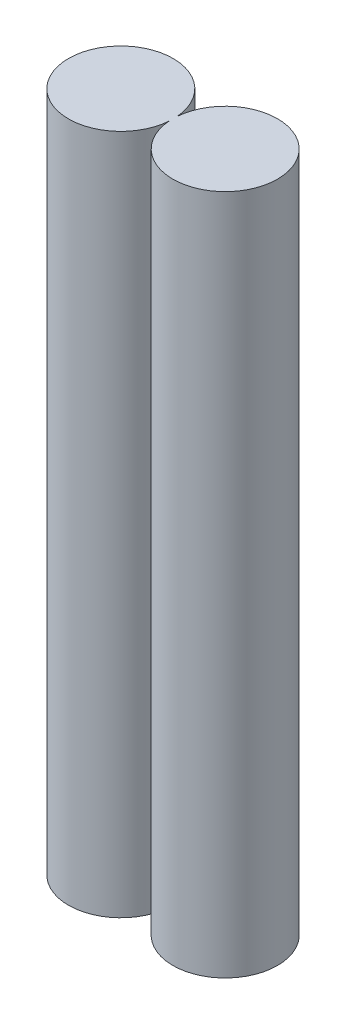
ISO-10303-21;
HEADER;
FILE_DESCRIPTION(('STEP AP214'),'2;1');
FILE_NAME('part.step','',(''),(''),'','','');
FILE_SCHEMA(('AUTOMOTIVE_DESIGN { 1 0 10303 214 1 1 1 1 }'));
ENDSEC;
DATA;
#1=APPLICATION_CONTEXT('core data for automotive mechanical design processes');
#2=APPLICATION_PROTOCOL_DEFINITION('international standard','automotive_design',2000,#1);
#3=PRODUCT_CONTEXT('',#1,'mechanical');
#4=PRODUCT('Part','Part','',(#3));
#5=PRODUCT_RELATED_PRODUCT_CATEGORY('part','',(#4));
#6=PRODUCT_DEFINITION_FORMATION('','',#4);
#7=PRODUCT_DEFINITION_CONTEXT('part definition',#1,'design');
#8=PRODUCT_DEFINITION('design','',#6,#7);
#9=PRODUCT_DEFINITION_SHAPE('','',#8);
#10=(LENGTH_UNIT() NAMED_UNIT(*) SI_UNIT(.MILLI.,.METRE.));
#11=(NAMED_UNIT(*) PLANE_ANGLE_UNIT() SI_UNIT($,.RADIAN.));
#12=(NAMED_UNIT(*) SI_UNIT($,.STERADIAN.) SOLID_ANGLE_UNIT());
#13=UNCERTAINTY_MEASURE_WITH_UNIT(LENGTH_MEASURE(1.E-05),#10,'distance_accuracy_value','');
#14=(GEOMETRIC_REPRESENTATION_CONTEXT(3) GLOBAL_UNCERTAINTY_ASSIGNED_CONTEXT((#13)) GLOBAL_UNIT_ASSIGNED_CONTEXT((#10,
#11,#12)) REPRESENTATION_CONTEXT('',''));
#15=CARTESIAN_POINT('',(0.,0.,0.));
#16=DIRECTION('',(0.,0.,1.));
#17=DIRECTION('',(1.,0.,0.));
#18=AXIS2_PLACEMENT_3D('',#15,#16,#17);
#19=CARTESIAN_POINT('',(0.,225.425,0.));
#20=DIRECTION('',(0.,-1.,0.));
#21=DIRECTION('',(0.,0.,-1.));
#22=AXIS2_PLACEMENT_3D('',#19,#20,#21);
#23=CYLINDRICAL_SURFACE('',#22,17.3228);
#24=DIRECTION('',(0.,-1.,0.));
#25=VECTOR('',#24,1.);
#26=CARTESIAN_POINT('',(-17.272,112.7125,-1.32567561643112));
#27=LINE('',#26,#25);
#28=CARTESIAN_POINT('',(-17.272,225.425,-1.32567561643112));
#29=VERTEX_POINT('',#28);
#30=CARTESIAN_POINT('',(-17.272,0.,-1.32567561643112));
#31=VERTEX_POINT('',#30);
#32=EDGE_CURVE('E47',#29,#31,#27,.T.);
#33=ORIENTED_EDGE('',*,*,#32,.F.);
#34=CARTESIAN_POINT('',(0.,225.425,0.));
#35=DIRECTION('',(0.,1.,0.));
#36=DIRECTION('',(0.,0.,1.));
#37=AXIS2_PLACEMENT_3D('',#34,#35,#36);
#38=CIRCLE('',#37,17.3228);
#39=CARTESIAN_POINT('',(-17.272,225.425,1.32567561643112));
#40=VERTEX_POINT('',#39);
#41=EDGE_CURVE('E11',#40,#29,#38,.T.);
#42=ORIENTED_EDGE('',*,*,#41,.F.);
#43=DIRECTION('',(0.,-1.,0.));
#44=VECTOR('',#43,1.);
#45=CARTESIAN_POINT('',(-17.272,112.7125,1.32567561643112));
#46=LINE('',#45,#44);
#47=CARTESIAN_POINT('',(-17.272,0.,1.32567561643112));
#48=VERTEX_POINT('',#47);
#49=EDGE_CURVE('E57',#48,#40,#46,.F.);
#50=ORIENTED_EDGE('',*,*,#49,.F.);
#51=CARTESIAN_POINT('',(0.,0.,0.));
#52=DIRECTION('',(0.,1.,0.));
#53=DIRECTION('',(0.,0.,1.));
#54=AXIS2_PLACEMENT_3D('',#51,#52,#53);
#55=CIRCLE('',#54,17.3228);
#56=EDGE_CURVE('E37',#48,#31,#55,.T.);
#57=ORIENTED_EDGE('',*,*,#56,.T.);
#58=EDGE_LOOP('',(#33,#42,#50,#57));
#59=FACE_BOUND('',#58,.T.);
#60=ADVANCED_FACE('F30',(#59),#23,.T.);
#61=CARTESIAN_POINT('',(0.,225.425,0.));
#62=DIRECTION('',(0.,1.,0.));
#63=DIRECTION('',(0.,0.,1.));
#64=AXIS2_PLACEMENT_3D('',#61,#62,#63);
#65=PLANE('',#64);
#66=ORIENTED_EDGE('',*,*,#41,.T.);
#67=CARTESIAN_POINT('',(-34.544,225.425,0.));
#68=DIRECTION('',(0.,1.,0.));
#69=DIRECTION('',(0.,0.,1.));
#70=AXIS2_PLACEMENT_3D('',#67,#68,#69);
#71=CIRCLE('',#70,17.3228);
#72=EDGE_CURVE('E61',#29,#40,#71,.T.);
#73=ORIENTED_EDGE('',*,*,#72,.T.);
#74=EDGE_LOOP('',(#66,#73));
#75=FACE_BOUND('',#74,.T.);
#76=ADVANCED_FACE('F68',(#75),#65,.T.);
#77=CARTESIAN_POINT('',(0.,0.,0.));
#78=DIRECTION('',(0.,1.,0.));
#79=DIRECTION('',(0.,0.,1.));
#80=AXIS2_PLACEMENT_3D('',#77,#78,#79);
#81=PLANE('',#80);
#82=ORIENTED_EDGE('',*,*,#56,.F.);
#83=CARTESIAN_POINT('',(-34.544,0.,0.));
#84=DIRECTION('',(0.,1.,0.));
#85=DIRECTION('',(0.,0.,1.));
#86=AXIS2_PLACEMENT_3D('',#83,#84,#85);
#87=CIRCLE('',#86,17.3228);
#88=EDGE_CURVE('E56',#31,#48,#87,.T.);
#89=ORIENTED_EDGE('',*,*,#88,.F.);
#90=EDGE_LOOP('',(#82,#89));
#91=FACE_BOUND('',#90,.T.);
#92=ADVANCED_FACE('F54',(#91),#81,.F.);
#93=CARTESIAN_POINT('',(-34.544,225.425,0.));
#94=DIRECTION('',(0.,-1.,0.));
#95=DIRECTION('',(0.,0.,-1.));
#96=AXIS2_PLACEMENT_3D('',#93,#94,#95);
#97=CYLINDRICAL_SURFACE('',#96,17.3228);
#98=ORIENTED_EDGE('',*,*,#72,.F.);
#99=ORIENTED_EDGE('',*,*,#32,.T.);
#100=ORIENTED_EDGE('',*,*,#88,.T.);
#101=ORIENTED_EDGE('',*,*,#49,.T.);
#102=EDGE_LOOP('',(#98,#99,#100,#101));
#103=FACE_BOUND('',#102,.T.);
#104=ADVANCED_FACE('F63',(#103),#97,.T.);
#105=CLOSED_SHELL('',(#60,#76,#92,#104));
#106=MANIFOLD_SOLID_BREP('B2',#105);
#107=ADVANCED_BREP_SHAPE_REPRESENTATION('',(#18,#106),#14);
#108=SHAPE_DEFINITION_REPRESENTATION(#9,#107);
ENDSEC;
END-ISO-10303-21;
